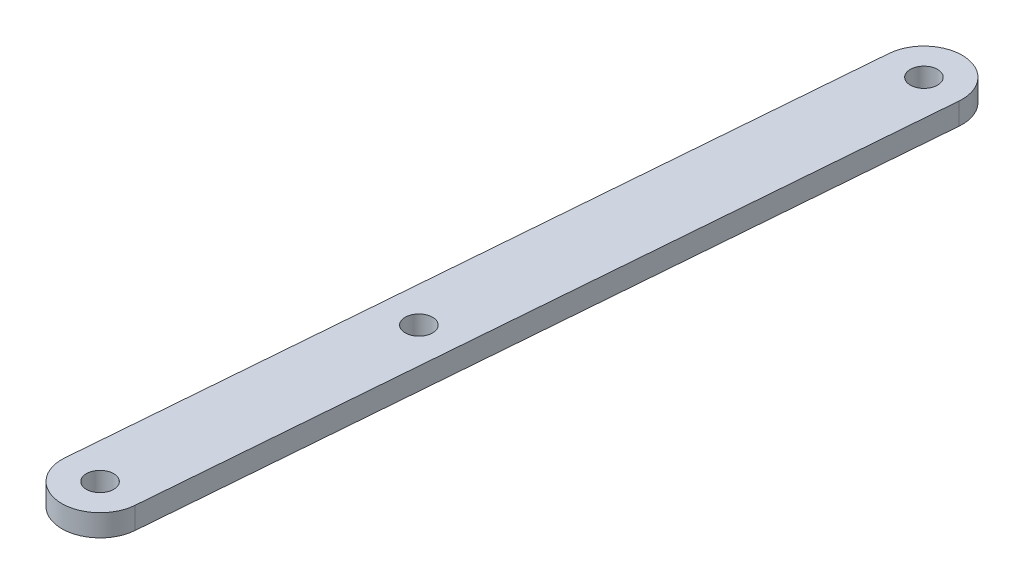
from build123d import *

# Parameters (mm, degrees)
SKETCH1_R          = 1.5875
EXTRUDE1_DEPTH     = 2.54
SKETCH2_R          = 1.5875
CUT_EXTRUDE1_DEPTH = 150.684221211


with BuildPart() as part:
    # Sketch1 → Extrude1 (new body)
    with BuildSketch(Plane(origin=(0, 7.62, 0), x_dir=(1, 0, 0), z_dir=(0, 1, 0))):
        with BuildLine():
            Line((66.668269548, 32.020038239), (73.861219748, 120.628567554))
            ThreePointArc((73.861219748, 120.628567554), (78.651293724, 124.69934651), (82.72207268, 119.909272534))
            Line((82.72207268, 119.909272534), (75.529122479, 31.300743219))
            ThreePointArc((75.529122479, 31.300743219), (70.739048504, 27.229964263), (66.668269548, 32.020038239))
        make_face()
        with Locations(Location((73.882245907, 65.950390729, 0), (0, 0, 270))):
            Circle(SKETCH1_R, mode=Mode.SUBTRACT)
        with Locations(Location((71.098696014, 31.660390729, 0), (0, 0, 270))):
            Circle(SKETCH1_R, mode=Mode.SUBTRACT)
    extrude(amount=EXTRUDE1_DEPTH)

    # Sketch2 → Cut-Extrude1 (cut, through all)
    with BuildSketch(Plane(origin=(0, 10.16, 0), x_dir=(1, 0, 0), z_dir=(0, 1, 0))):
        with Locations(Location((78.291646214, 120.268920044, 0), (0, 0, 270))):
            Circle(SKETCH2_R)
    extrude(amount=-CUT_EXTRUDE1_DEPTH, mode=Mode.SUBTRACT)


solid = part.part
